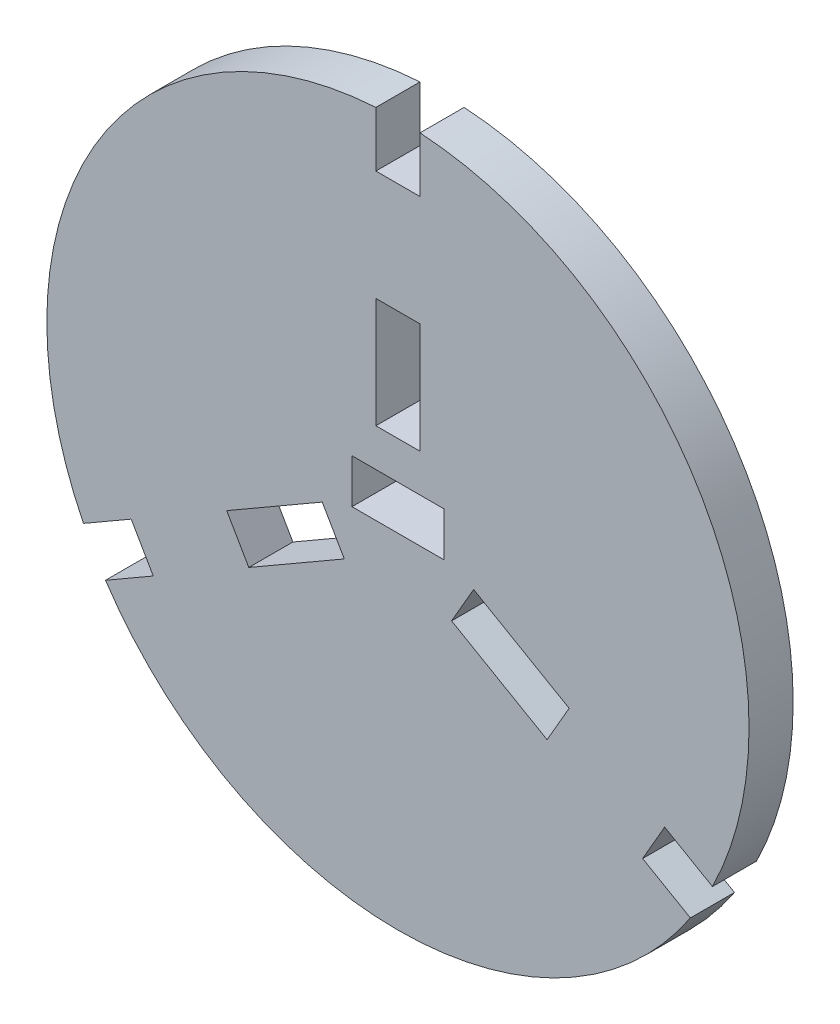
from build123d import *

# Parameters (mm, degrees)
SKETCH1_W           = 12
SKETCH1_H           = 30
BOSS_EXTRUDE1_DEPTH = 12
SKETCH2_W           = 25
SKETCH2_H           = 12
CUT_EXTRUDE1_DEPTH  = 20


with BuildPart() as part:
    # Sketch1 → Boss-Extrude1 (new body)
    with BuildSketch(Plane.XY):
        with BuildLine():
            Line((85.542034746, -42.459513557), (72.551653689, -34.959513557))
            Line((72.551653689, -34.959513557), (66.551653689, -45.351818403))
            Line((66.551653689, -45.351818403), (79.542034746, -52.851818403))
            ThreePointArc((79.542034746, -52.851818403), (0, -95.5), (-79.542034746, -52.851818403))
            Line((-79.542034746, -52.851818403), (-66.551653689, -45.351818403))
            Line((-66.551653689, -45.351818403), (-72.551653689, -34.959513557))
            Line((-72.551653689, -34.959513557), (-85.542034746, -42.459513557))
            ThreePointArc((-85.542034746, -42.459513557), (-82.705426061, 47.75), (-6, 95.31133196))
            Line((-6, 95.31133196), (-6, 80.31133196))
            Line((-6, 80.31133196), (6, 80.31133196))
            Line((6, 80.31133196), (6, 95.31133196))
            ThreePointArc((6, 95.31133196), (82.705426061, 47.75), (85.542034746, -42.459513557))
        make_face()
        with Locations((0, 35.31133196)):
            Rectangle(SKETCH1_W, SKETCH1_H, mode=Mode.SUBTRACT)
        Polygon((46.570891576, -19.959513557), (40.570891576, -30.351818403), (14.590129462, -15.351818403), (20.590129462, -4.959513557), align=None, mode=Mode.SUBTRACT)
        Polygon((-40.570891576, -30.351818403), (-46.570891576, -19.959513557), (-20.590129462, -4.959513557), (-14.590129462, -15.351818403), align=None, mode=Mode.SUBTRACT)
    extrude(amount=BOSS_EXTRUDE1_DEPTH)

    # Sketch2 → Cut-Extrude1 (cut)
    with BuildSketch(Plane.XY.offset(12)):
        with Locations((0, 4)):
            Rectangle(SKETCH2_W, SKETCH2_H)
    extrude(amount=-CUT_EXTRUDE1_DEPTH, mode=Mode.SUBTRACT)


solid = part.part
